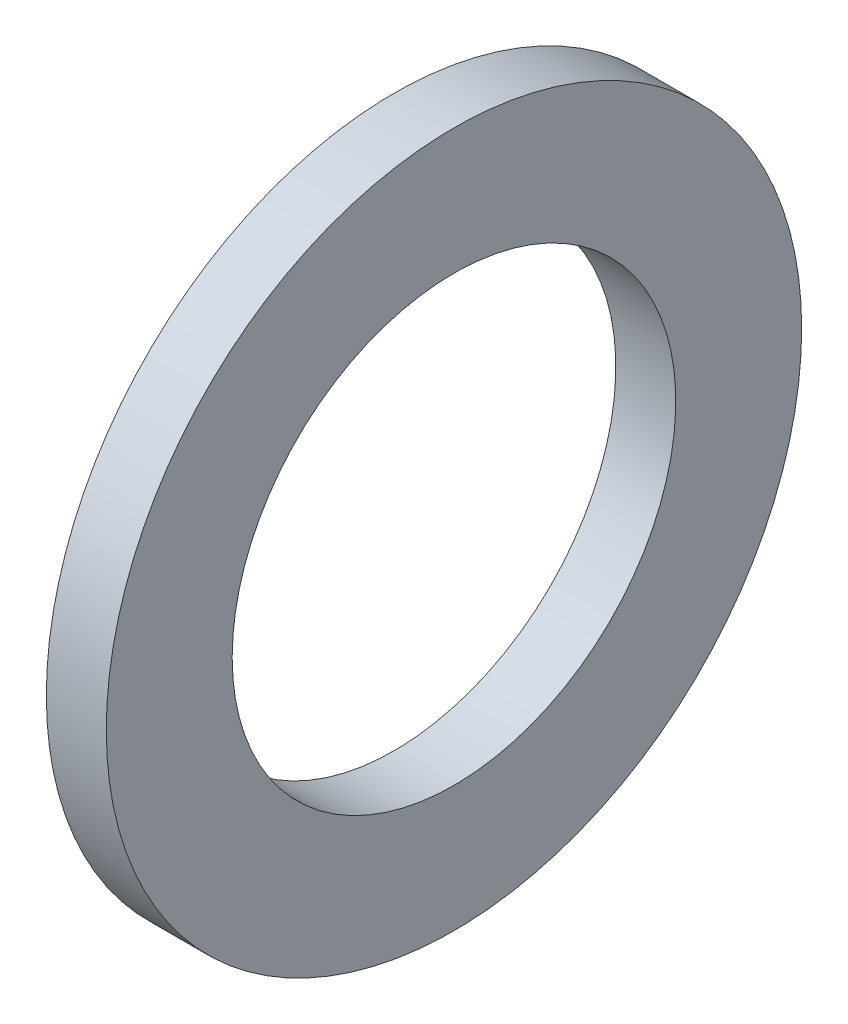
from build123d import *

# Parameters (mm, degrees)
SKETCH1_W = 5
SKETCH1_H = 10.5


with BuildPart() as part:
    # Sketch1 → Base-Revolve (revolve)
    with BuildSketch(Plane.XY, mode=Mode.PRIVATE) as base_revolve_sk:
        with Locations((-2.5, 23.75)):
            Rectangle(SKETCH1_W, SKETCH1_H)
    revolve(base_revolve_sk.sketch.rotate(Axis((-34.925, 0, 0), (1, 0, 0)), 90), axis=Axis((-34.925, 0, 0), (1, 0, 0)))


solid = part.part
